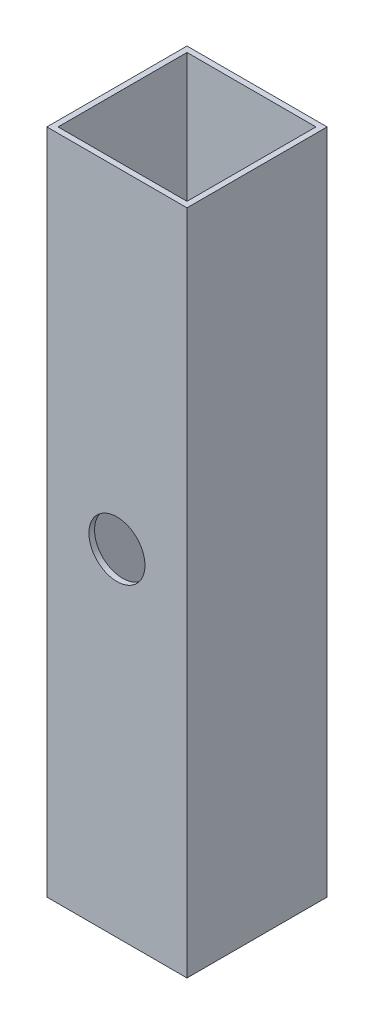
ISO-10303-21;
HEADER;
FILE_DESCRIPTION(('STEP AP214'),'2;1');
FILE_NAME('part.step','',(''),(''),'','','');
FILE_SCHEMA(('AUTOMOTIVE_DESIGN { 1 0 10303 214 1 1 1 1 }'));
ENDSEC;
DATA;
#1=APPLICATION_CONTEXT('core data for automotive mechanical design processes');
#2=APPLICATION_PROTOCOL_DEFINITION('international standard','automotive_design',2000,#1);
#3=PRODUCT_CONTEXT('',#1,'mechanical');
#4=PRODUCT('Part','Part','',(#3));
#5=PRODUCT_RELATED_PRODUCT_CATEGORY('part','',(#4));
#6=PRODUCT_DEFINITION_FORMATION('','',#4);
#7=PRODUCT_DEFINITION_CONTEXT('part definition',#1,'design');
#8=PRODUCT_DEFINITION('design','',#6,#7);
#9=PRODUCT_DEFINITION_SHAPE('','',#8);
#10=(LENGTH_UNIT() NAMED_UNIT(*) SI_UNIT(.MILLI.,.METRE.));
#11=(NAMED_UNIT(*) PLANE_ANGLE_UNIT() SI_UNIT($,.RADIAN.));
#12=(NAMED_UNIT(*) SI_UNIT($,.STERADIAN.) SOLID_ANGLE_UNIT());
#13=UNCERTAINTY_MEASURE_WITH_UNIT(LENGTH_MEASURE(1.E-05),#10,'distance_accuracy_value','');
#14=(GEOMETRIC_REPRESENTATION_CONTEXT(3) GLOBAL_UNCERTAINTY_ASSIGNED_CONTEXT((#13)) GLOBAL_UNIT_ASSIGNED_CONTEXT((#10,
#11,#12)) REPRESENTATION_CONTEXT('',''));
#15=CARTESIAN_POINT('',(0.,0.,0.));
#16=DIRECTION('',(0.,0.,1.));
#17=DIRECTION('',(1.,0.,0.));
#18=AXIS2_PLACEMENT_3D('',#15,#16,#17);
#19=CARTESIAN_POINT('',(0.,-304.8,0.));
#20=DIRECTION('',(-1.,0.,0.));
#21=DIRECTION('',(0.,0.,1.));
#22=AXIS2_PLACEMENT_3D('',#19,#20,#21);
#23=PLANE('',#22);
#24=DIRECTION('',(0.,0.,1.));
#25=VECTOR('',#24,1.);
#26=CARTESIAN_POINT('',(0.,-2.54,0.));
#27=LINE('',#26,#25);
#28=CARTESIAN_POINT('',(0.,-2.54,-63.5));
#29=VERTEX_POINT('',#28);
#30=CARTESIAN_POINT('',(0.,-2.5400000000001,0.));
#31=VERTEX_POINT('',#30);
#32=EDGE_CURVE('E58',#29,#31,#27,.T.);
#33=ORIENTED_EDGE('',*,*,#32,.F.);
#34=DIRECTION('',(0.,1.,0.));
#35=VECTOR('',#34,1.);
#36=CARTESIAN_POINT('',(0.,-304.8,-63.5));
#37=LINE('',#36,#35);
#38=CARTESIAN_POINT('',(0.,-304.8,-63.5));
#39=VERTEX_POINT('',#38);
#40=EDGE_CURVE('E51',#39,#29,#37,.T.);
#41=ORIENTED_EDGE('',*,*,#40,.F.);
#42=DIRECTION('',(0.,0.,1.));
#43=VECTOR('',#42,1.);
#44=CARTESIAN_POINT('',(0.,-304.8,0.));
#45=LINE('',#44,#43);
#46=CARTESIAN_POINT('',(0.,-304.8,0.));
#47=VERTEX_POINT('',#46);
#48=EDGE_CURVE('E148',#39,#47,#45,.T.);
#49=ORIENTED_EDGE('',*,*,#48,.T.);
#50=DIRECTION('',(0.,1.,0.));
#51=VECTOR('',#50,1.);
#52=CARTESIAN_POINT('',(0.,-304.8,0.));
#53=LINE('',#52,#51);
#54=EDGE_CURVE('E129',#47,#31,#53,.T.);
#55=ORIENTED_EDGE('',*,*,#54,.T.);
#56=EDGE_LOOP('',(#33,#41,#49,#55));
#57=FACE_BOUND('',#56,.T.);
#58=ADVANCED_FACE('F42',(#57),#23,.T.);
#59=CARTESIAN_POINT('',(0.,-304.8,-63.5));
#60=DIRECTION('',(0.,0.,-1.));
#61=DIRECTION('',(-1.,0.,0.));
#62=AXIS2_PLACEMENT_3D('',#59,#60,#61);
#63=PLANE('',#62);
#64=DIRECTION('',(-1.,0.,0.));
#65=VECTOR('',#64,1.);
#66=CARTESIAN_POINT('',(0.,-2.54,-63.5));
#67=LINE('',#66,#65);
#68=CARTESIAN_POINT('',(63.5,-2.54,-63.5));
#69=VERTEX_POINT('',#68);
#70=EDGE_CURVE('E122',#69,#29,#67,.T.);
#71=ORIENTED_EDGE('',*,*,#70,.F.);
#72=DIRECTION('',(0.,1.,0.));
#73=VECTOR('',#72,1.);
#74=CARTESIAN_POINT('',(63.5,-304.8,-63.5));
#75=LINE('',#74,#73);
#76=CARTESIAN_POINT('',(63.5,-304.8,-63.5));
#77=VERTEX_POINT('',#76);
#78=EDGE_CURVE('E120',#77,#69,#75,.T.);
#79=ORIENTED_EDGE('',*,*,#78,.F.);
#80=DIRECTION('',(-1.,0.,0.));
#81=VECTOR('',#80,1.);
#82=CARTESIAN_POINT('',(0.,-304.8,-63.5));
#83=LINE('',#82,#81);
#84=EDGE_CURVE('E134',#77,#39,#83,.T.);
#85=ORIENTED_EDGE('',*,*,#84,.T.);
#86=ORIENTED_EDGE('',*,*,#40,.T.);
#87=EDGE_LOOP('',(#71,#79,#85,#86));
#88=FACE_BOUND('',#87,.T.);
#89=ADVANCED_FACE('F217',(#88),#63,.T.);
#90=CARTESIAN_POINT('',(63.5,-304.8,0.));
#91=DIRECTION('',(1.,0.,0.));
#92=DIRECTION('',(0.,0.,-1.));
#93=AXIS2_PLACEMENT_3D('',#90,#91,#92);
#94=PLANE('',#93);
#95=DIRECTION('',(0.,0.,-1.));
#96=VECTOR('',#95,1.);
#97=CARTESIAN_POINT('',(63.5,-2.54,0.));
#98=LINE('',#97,#96);
#99=CARTESIAN_POINT('',(63.5,-2.54,0.));
#100=VERTEX_POINT('',#99);
#101=EDGE_CURVE('E107',#100,#69,#98,.T.);
#102=ORIENTED_EDGE('',*,*,#101,.F.);
#103=DIRECTION('',(0.,1.,0.));
#104=VECTOR('',#103,1.);
#105=CARTESIAN_POINT('',(63.5,-304.8,0.));
#106=LINE('',#105,#104);
#107=CARTESIAN_POINT('',(63.5,-304.8,0.));
#108=VERTEX_POINT('',#107);
#109=EDGE_CURVE('E118',#108,#100,#106,.T.);
#110=ORIENTED_EDGE('',*,*,#109,.F.);
#111=DIRECTION('',(0.,0.,-1.));
#112=VECTOR('',#111,1.);
#113=CARTESIAN_POINT('',(63.5,-304.8,0.));
#114=LINE('',#113,#112);
#115=EDGE_CURVE('E143',#108,#77,#114,.T.);
#116=ORIENTED_EDGE('',*,*,#115,.T.);
#117=ORIENTED_EDGE('',*,*,#78,.T.);
#118=EDGE_LOOP('',(#102,#110,#116,#117));
#119=FACE_BOUND('',#118,.T.);
#120=ADVANCED_FACE('F116',(#119),#94,.T.);
#121=CARTESIAN_POINT('',(0.,-304.8,0.));
#122=DIRECTION('',(0.,0.,1.));
#123=DIRECTION('',(1.,0.,0.));
#124=AXIS2_PLACEMENT_3D('',#121,#122,#123);
#125=PLANE('',#124);
#126=CARTESIAN_POINT('',(31.75,-152.4,0.));
#127=DIRECTION('',(0.,0.,1.));
#128=DIRECTION('',(1.,0.,0.));
#129=AXIS2_PLACEMENT_3D('',#126,#127,#128);
#130=CIRCLE('',#129,12.7);
#131=CARTESIAN_POINT('',(44.45,-152.4,0.));
#132=VERTEX_POINT('',#131);
#133=EDGE_CURVE('E195',#132,#132,#130,.T.);
#134=ORIENTED_EDGE('',*,*,#133,.F.);
#135=EDGE_LOOP('',(#134));
#136=FACE_BOUND('',#135,.T.);
#137=DIRECTION('',(1.,0.,0.));
#138=VECTOR('',#137,1.);
#139=CARTESIAN_POINT('',(0.,-2.54,0.));
#140=LINE('',#139,#138);
#141=EDGE_CURVE('E104',#31,#100,#140,.T.);
#142=ORIENTED_EDGE('',*,*,#141,.F.);
#143=ORIENTED_EDGE('',*,*,#54,.F.);
#144=DIRECTION('',(1.,0.,0.));
#145=VECTOR('',#144,1.);
#146=CARTESIAN_POINT('',(0.,-304.8,0.));
#147=LINE('',#146,#145);
#148=EDGE_CURVE('E127',#47,#108,#147,.T.);
#149=ORIENTED_EDGE('',*,*,#148,.T.);
#150=ORIENTED_EDGE('',*,*,#109,.T.);
#151=EDGE_LOOP('',(#142,#143,#149,#150));
#152=FACE_BOUND('',#151,.T.);
#153=ADVANCED_FACE('F125',(#136,#152),#125,.T.);
#154=CARTESIAN_POINT('',(0.,-304.8,0.));
#155=DIRECTION('',(0.,-1.,0.));
#156=DIRECTION('',(0.,0.,-1.));
#157=AXIS2_PLACEMENT_3D('',#154,#155,#156);
#158=PLANE('',#157);
#159=ORIENTED_EDGE('',*,*,#48,.F.);
#160=ORIENTED_EDGE('',*,*,#84,.F.);
#161=ORIENTED_EDGE('',*,*,#115,.F.);
#162=ORIENTED_EDGE('',*,*,#148,.F.);
#163=EDGE_LOOP('',(#159,#160,#161,#162));
#164=FACE_BOUND('',#163,.T.);
#165=ADVANCED_FACE('F227',(#164),#158,.T.);
#166=CARTESIAN_POINT('',(0.,-2.54,0.));
#167=DIRECTION('',(0.,-1.,0.));
#168=DIRECTION('',(0.,0.,-1.));
#169=AXIS2_PLACEMENT_3D('',#166,#167,#168);
#170=PLANE('',#169);
#171=ORIENTED_EDGE('',*,*,#32,.T.);
#172=ORIENTED_EDGE('',*,*,#141,.T.);
#173=ORIENTED_EDGE('',*,*,#101,.T.);
#174=ORIENTED_EDGE('',*,*,#70,.T.);
#175=EDGE_LOOP('',(#171,#172,#173,#174));
#176=FACE_BOUND('',#175,.T.);
#177=DIRECTION('',(0.,0.,-1.));
#178=VECTOR('',#177,1.);
#179=CARTESIAN_POINT('',(2.54,-2.53999999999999,0.));
#180=LINE('',#179,#178);
#181=CARTESIAN_POINT('',(2.54,-2.53999999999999,-2.54));
#182=VERTEX_POINT('',#181);
#183=CARTESIAN_POINT('',(2.54,-2.53999999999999,-60.96));
#184=VERTEX_POINT('',#183);
#185=EDGE_CURVE('E186',#182,#184,#180,.T.);
#186=ORIENTED_EDGE('',*,*,#185,.T.);
#187=DIRECTION('',(1.,0.,0.));
#188=VECTOR('',#187,1.);
#189=CARTESIAN_POINT('',(0.,-2.53999999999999,-60.96));
#190=LINE('',#189,#188);
#191=CARTESIAN_POINT('',(60.96,-2.53999999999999,-60.96));
#192=VERTEX_POINT('',#191);
#193=EDGE_CURVE('E66',#184,#192,#190,.T.);
#194=ORIENTED_EDGE('',*,*,#193,.T.);
#195=DIRECTION('',(0.,0.,-1.));
#196=VECTOR('',#195,1.);
#197=CARTESIAN_POINT('',(60.96,-2.53999999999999,0.));
#198=LINE('',#197,#196);
#199=CARTESIAN_POINT('',(60.96,-2.53999999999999,-2.54));
#200=VERTEX_POINT('',#199);
#201=EDGE_CURVE('E11',#200,#192,#198,.T.);
#202=ORIENTED_EDGE('',*,*,#201,.F.);
#203=DIRECTION('',(1.,0.,0.));
#204=VECTOR('',#203,1.);
#205=CARTESIAN_POINT('',(0.,-2.53999999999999,-2.54));
#206=LINE('',#205,#204);
#207=EDGE_CURVE('E182',#182,#200,#206,.T.);
#208=ORIENTED_EDGE('',*,*,#207,.F.);
#209=EDGE_LOOP('',(#186,#194,#202,#208));
#210=FACE_BOUND('',#209,.T.);
#211=ADVANCED_FACE('F106',(#176,#210),#170,.F.);
#212=CARTESIAN_POINT('',(0.,-302.26,0.));
#213=DIRECTION('',(0.,1.,0.));
#214=DIRECTION('',(0.,0.,1.));
#215=AXIS2_PLACEMENT_3D('',#212,#213,#214);
#216=PLANE('',#215);
#217=DIRECTION('',(1.,0.,0.));
#218=VECTOR('',#217,1.);
#219=CARTESIAN_POINT('',(0.,-302.26,-2.54));
#220=LINE('',#219,#218);
#221=CARTESIAN_POINT('',(2.54,-302.26,-2.54));
#222=VERTEX_POINT('',#221);
#223=CARTESIAN_POINT('',(60.96,-302.26,-2.54));
#224=VERTEX_POINT('',#223);
#225=EDGE_CURVE('E178',#222,#224,#220,.T.);
#226=ORIENTED_EDGE('',*,*,#225,.T.);
#227=DIRECTION('',(0.,0.,-1.));
#228=VECTOR('',#227,1.);
#229=CARTESIAN_POINT('',(60.96,-302.26,0.));
#230=LINE('',#229,#228);
#231=CARTESIAN_POINT('',(60.96,-302.26,-60.96));
#232=VERTEX_POINT('',#231);
#233=EDGE_CURVE('E174',#224,#232,#230,.T.);
#234=ORIENTED_EDGE('',*,*,#233,.T.);
#235=DIRECTION('',(1.,0.,0.));
#236=VECTOR('',#235,1.);
#237=CARTESIAN_POINT('',(0.,-302.26,-60.96));
#238=LINE('',#237,#236);
#239=CARTESIAN_POINT('',(2.54,-302.26,-60.96));
#240=VERTEX_POINT('',#239);
#241=EDGE_CURVE('E171',#240,#232,#238,.T.);
#242=ORIENTED_EDGE('',*,*,#241,.F.);
#243=DIRECTION('',(0.,0.,-1.));
#244=VECTOR('',#243,1.);
#245=CARTESIAN_POINT('',(2.54,-302.26,0.));
#246=LINE('',#245,#244);
#247=EDGE_CURVE('E158',#222,#240,#246,.T.);
#248=ORIENTED_EDGE('',*,*,#247,.F.);
#249=EDGE_LOOP('',(#226,#234,#242,#248));
#250=FACE_BOUND('',#249,.T.);
#251=ADVANCED_FACE('F234',(#250),#216,.T.);
#252=CARTESIAN_POINT('',(60.96,-302.26,0.));
#253=DIRECTION('',(1.,0.,0.));
#254=DIRECTION('',(0.,0.,-1.));
#255=AXIS2_PLACEMENT_3D('',#252,#253,#254);
#256=PLANE('',#255);
#257=DIRECTION('',(0.,1.,0.));
#258=VECTOR('',#257,1.);
#259=CARTESIAN_POINT('',(60.96,-302.26,-2.54));
#260=LINE('',#259,#258);
#261=EDGE_CURVE('E153',#224,#200,#260,.T.);
#262=ORIENTED_EDGE('',*,*,#261,.T.);
#263=ORIENTED_EDGE('',*,*,#201,.T.);
#264=DIRECTION('',(0.,1.,0.));
#265=VECTOR('',#264,1.);
#266=CARTESIAN_POINT('',(60.96,-302.26,-60.96));
#267=LINE('',#266,#265);
#268=EDGE_CURVE('E157',#232,#192,#267,.T.);
#269=ORIENTED_EDGE('',*,*,#268,.F.);
#270=ORIENTED_EDGE('',*,*,#233,.F.);
#271=EDGE_LOOP('',(#262,#263,#269,#270));
#272=FACE_BOUND('',#271,.T.);
#273=ADVANCED_FACE('F286',(#272),#256,.F.);
#274=CARTESIAN_POINT('',(0.,-302.26,-60.96));
#275=DIRECTION('',(0.,0.,1.));
#276=DIRECTION('',(1.,0.,0.));
#277=AXIS2_PLACEMENT_3D('',#274,#275,#276);
#278=PLANE('',#277);
#279=ORIENTED_EDGE('',*,*,#193,.F.);
#280=DIRECTION('',(0.,1.,0.));
#281=VECTOR('',#280,1.);
#282=CARTESIAN_POINT('',(2.54,-302.26,-60.96));
#283=LINE('',#282,#281);
#284=EDGE_CURVE('E162',#240,#184,#283,.T.);
#285=ORIENTED_EDGE('',*,*,#284,.F.);
#286=ORIENTED_EDGE('',*,*,#241,.T.);
#287=ORIENTED_EDGE('',*,*,#268,.T.);
#288=EDGE_LOOP('',(#279,#285,#286,#287));
#289=FACE_BOUND('',#288,.T.);
#290=ADVANCED_FACE('F296',(#289),#278,.T.);
#291=CARTESIAN_POINT('',(2.54,-302.26,0.));
#292=DIRECTION('',(1.,0.,0.));
#293=DIRECTION('',(0.,0.,-1.));
#294=AXIS2_PLACEMENT_3D('',#291,#292,#293);
#295=PLANE('',#294);
#296=ORIENTED_EDGE('',*,*,#185,.F.);
#297=DIRECTION('',(0.,1.,0.));
#298=VECTOR('',#297,1.);
#299=CARTESIAN_POINT('',(2.54,-302.26,-2.54));
#300=LINE('',#299,#298);
#301=EDGE_CURVE('E152',#222,#182,#300,.T.);
#302=ORIENTED_EDGE('',*,*,#301,.F.);
#303=ORIENTED_EDGE('',*,*,#247,.T.);
#304=ORIENTED_EDGE('',*,*,#284,.T.);
#305=EDGE_LOOP('',(#296,#302,#303,#304));
#306=FACE_BOUND('',#305,.T.);
#307=ADVANCED_FACE('F213',(#306),#295,.T.);
#308=CARTESIAN_POINT('',(0.,-302.26,-2.54));
#309=DIRECTION('',(0.,0.,1.));
#310=DIRECTION('',(1.,0.,0.));
#311=AXIS2_PLACEMENT_3D('',#308,#309,#310);
#312=PLANE('',#311);
#313=CARTESIAN_POINT('',(31.75,-152.4,-2.54));
#314=DIRECTION('',(0.,0.,1.));
#315=DIRECTION('',(1.,0.,0.));
#316=AXIS2_PLACEMENT_3D('',#313,#314,#315);
#317=CIRCLE('',#316,12.7);
#318=CARTESIAN_POINT('',(44.45,-152.4,-2.54));
#319=VERTEX_POINT('',#318);
#320=EDGE_CURVE('E45',#319,#319,#317,.T.);
#321=ORIENTED_EDGE('',*,*,#320,.T.);
#322=EDGE_LOOP('',(#321));
#323=FACE_BOUND('',#322,.T.);
#324=ORIENTED_EDGE('',*,*,#301,.T.);
#325=ORIENTED_EDGE('',*,*,#207,.T.);
#326=ORIENTED_EDGE('',*,*,#261,.F.);
#327=ORIENTED_EDGE('',*,*,#225,.F.);
#328=EDGE_LOOP('',(#324,#325,#326,#327));
#329=FACE_BOUND('',#328,.T.);
#330=ADVANCED_FACE('F204',(#323,#329),#312,.F.);
#331=CARTESIAN_POINT('',(31.75,-152.4,-12.7));
#332=DIRECTION('',(0.,0.,1.));
#333=DIRECTION('',(1.,0.,0.));
#334=AXIS2_PLACEMENT_3D('',#331,#332,#333);
#335=CYLINDRICAL_SURFACE('',#334,12.7);
#336=ORIENTED_EDGE('',*,*,#133,.T.);
#337=EDGE_LOOP('',(#336));
#338=FACE_BOUND('',#337,.T.);
#339=ORIENTED_EDGE('',*,*,#320,.F.);
#340=EDGE_LOOP('',(#339));
#341=FACE_BOUND('',#340,.T.);
#342=ADVANCED_FACE('F207',(#338,#341),#335,.F.);
#343=CLOSED_SHELL('',(#58,#89,#120,#153,#165,#211,#251,#273,#290,#307,#330,#342));
#344=MANIFOLD_SOLID_BREP('B2',#343);
#345=ADVANCED_BREP_SHAPE_REPRESENTATION('',(#18,#344),#14);
#346=SHAPE_DEFINITION_REPRESENTATION(#9,#345);
ENDSEC;
END-ISO-10303-21;
